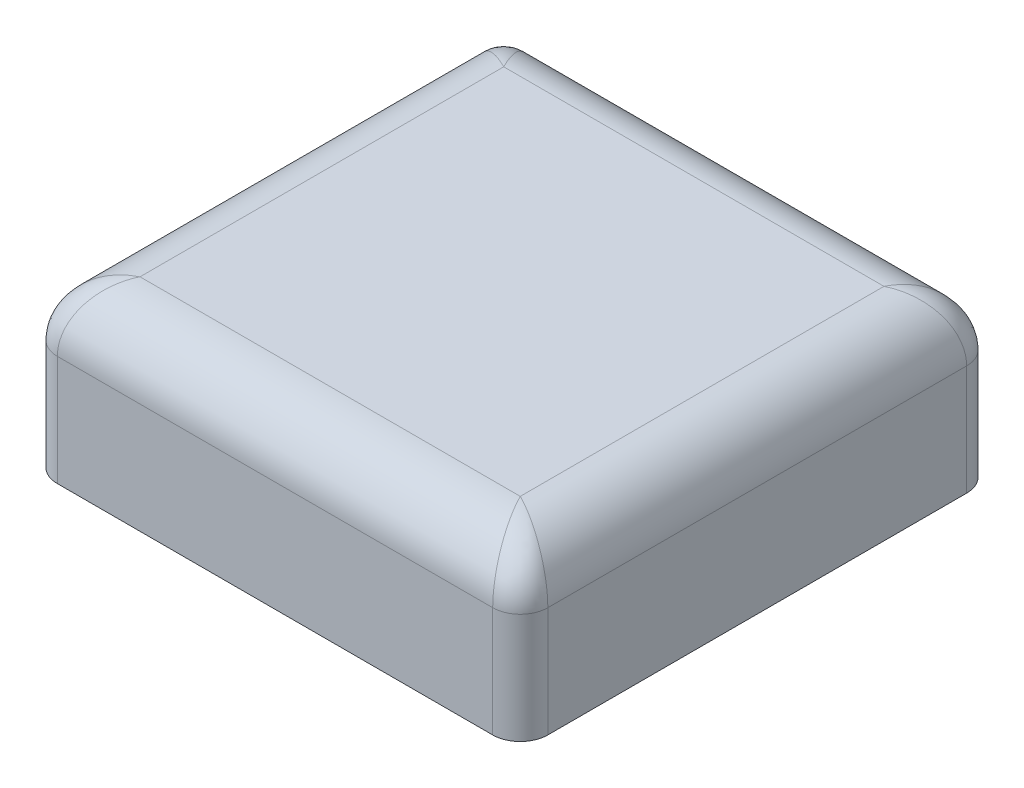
ISO-10303-21;
HEADER;
FILE_DESCRIPTION(('STEP AP214'),'2;1');
FILE_NAME('part.step','',(''),(''),'','','');
FILE_SCHEMA(('AUTOMOTIVE_DESIGN { 1 0 10303 214 1 1 1 1 }'));
ENDSEC;
DATA;
#1=APPLICATION_CONTEXT('core data for automotive mechanical design processes');
#2=APPLICATION_PROTOCOL_DEFINITION('international standard','automotive_design',2000,#1);
#3=PRODUCT_CONTEXT('',#1,'mechanical');
#4=PRODUCT('Part','Part','',(#3));
#5=PRODUCT_RELATED_PRODUCT_CATEGORY('part','',(#4));
#6=PRODUCT_DEFINITION_FORMATION('','',#4);
#7=PRODUCT_DEFINITION_CONTEXT('part definition',#1,'design');
#8=PRODUCT_DEFINITION('design','',#6,#7);
#9=PRODUCT_DEFINITION_SHAPE('','',#8);
#10=(LENGTH_UNIT() NAMED_UNIT(*) SI_UNIT(.MILLI.,.METRE.));
#11=(NAMED_UNIT(*) PLANE_ANGLE_UNIT() SI_UNIT($,.RADIAN.));
#12=(NAMED_UNIT(*) SI_UNIT($,.STERADIAN.) SOLID_ANGLE_UNIT());
#13=UNCERTAINTY_MEASURE_WITH_UNIT(LENGTH_MEASURE(1.E-05),#10,'distance_accuracy_value','');
#14=(GEOMETRIC_REPRESENTATION_CONTEXT(3) GLOBAL_UNCERTAINTY_ASSIGNED_CONTEXT((#13)) GLOBAL_UNIT_ASSIGNED_CONTEXT((#10,
#11,#12)) REPRESENTATION_CONTEXT('',''));
#15=CARTESIAN_POINT('',(0.,0.,0.));
#16=DIRECTION('',(0.,0.,1.));
#17=DIRECTION('',(1.,0.,0.));
#18=AXIS2_PLACEMENT_3D('',#15,#16,#17);
#19=CARTESIAN_POINT('',(6.9,6.,6.6));
#20=CARTESIAN_POINT('',(6.9,6.,6.6));
#21=CARTESIAN_POINT('',(6.9,6.,6.6));
#22=CARTESIAN_POINT('',(7.03092328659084,6.,6.86184657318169));
#23=CARTESIAN_POINT('',(7.09633697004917,5.99990745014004,6.79633697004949));
#24=CARTESIAN_POINT('',(7.16184657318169,6.,6.73092328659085));
#25=CARTESIAN_POINT('',(7.16174789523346,5.94794534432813,7.12349579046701));
#26=CARTESIAN_POINT('',(7.29743864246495,5.97379281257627,6.99743864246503));
#27=CARTESIAN_POINT('',(7.42349579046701,5.94794534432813,6.86174789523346));
#28=CARTESIAN_POINT('',(7.40361896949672,5.74757278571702,7.60723793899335));
#29=CARTESIAN_POINT('',(7.69066511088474,5.86499769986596,7.39066511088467));
#30=CARTESIAN_POINT('',(7.90723793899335,5.74757278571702,7.10361896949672));
#31=CARTESIAN_POINT('',(7.51454673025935,5.59933366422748,7.82909346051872));
#32=CARTESIAN_POINT('',(7.8912764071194,5.77802397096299,7.59127640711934));
#33=CARTESIAN_POINT('',(8.12909346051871,5.59933366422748,7.21454673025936));
#34=CARTESIAN_POINT('',(7.65338680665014,5.3216535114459,8.10677361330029));
#35=CARTESIAN_POINT('',(8.17839265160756,5.58157591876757,7.8783926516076));
#36=CARTESIAN_POINT('',(8.40677361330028,5.3216535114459,7.35338680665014));
#37=CARTESIAN_POINT('',(7.6951076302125,5.21997956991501,8.190215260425));
#38=CARTESIAN_POINT('',(8.27543637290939,5.50077375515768,7.97543637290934));
#39=CARTESIAN_POINT('',(8.490215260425,5.21997956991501,7.39510763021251));
#40=CARTESIAN_POINT('',(7.76783159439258,5.0023013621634,8.33566318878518));
#41=CARTESIAN_POINT('',(8.46254638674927,5.30395656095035,8.16254638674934));
#42=CARTESIAN_POINT('',(8.63566318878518,5.0023013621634,7.46783159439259));
#43=CARTESIAN_POINT('',(7.79883296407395,4.8863023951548,8.39766592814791));
#44=CARTESIAN_POINT('',(8.55188955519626,5.18653773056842,8.25188955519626));
#45=CARTESIAN_POINT('',(8.69766592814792,4.88630239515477,7.49883296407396));
#46=CARTESIAN_POINT('',(7.84892610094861,4.64443133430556,8.49785220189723));
#47=CARTESIAN_POINT('',(8.71080415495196,4.9084138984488,8.41080415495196));
#48=CARTESIAN_POINT('',(8.79785220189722,4.64443133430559,7.54892610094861));
#49=CARTESIAN_POINT('',(7.86801665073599,4.51856511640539,8.53603330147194));
#50=CARTESIAN_POINT('',(8.77831487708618,4.74763398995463,8.47831487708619));
#51=CARTESIAN_POINT('',(8.83603330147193,4.51856511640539,7.56801665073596));
#52=CARTESIAN_POINT('',(7.89355391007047,4.26179617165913,8.58710782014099));
#53=CARTESIAN_POINT('',(8.87406081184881,4.38998141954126,8.57406081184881));
#54=CARTESIAN_POINT('',(8.88710782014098,4.26179617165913,7.5935539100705));
#55=CARTESIAN_POINT('',(7.89999999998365,4.1309011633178,8.6));
#56=CARTESIAN_POINT('',(8.89999999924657,4.19659951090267,8.59999999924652));
#57=CARTESIAN_POINT('',(8.9,4.1309011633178,7.59999999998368));
#58=CARTESIAN_POINT('',(7.9,4.,8.6));
#59=CARTESIAN_POINT('',(8.9,4.,8.6));
#60=CARTESIAN_POINT('',(8.9,4.,7.6));
#61=(BOUNDED_SURFACE() B_SPLINE_SURFACE(3,2,((#19,#20,#21),(#22,#23,#24),(#25,#26,#27),(#28,#29,
#30),(#31,#32,#33),(#34,#35,#36),(#37,#38,#39),(#40,#41,#42),(#43,#44,#45),(#46,#47,#48),(#49,
#50,#51),(#52,#53,#54),(#55,#56,#57),(#58,#59,#60)),.UNSPECIFIED.,.F.,.F.,
.F.) B_SPLINE_SURFACE_WITH_KNOTS((4,2,2,2,2,2,4),(3,3),(1.5707963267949,1.96349540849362,
2.35619449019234,2.55254403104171,2.74889357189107,2.94524311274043,3.14159265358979),(0.,1.),
.UNSPECIFIED.) GEOMETRIC_REPRESENTATION_ITEM() RATIONAL_B_SPLINE_SURFACE(((1.,1.,1.),(1.,
1.00015858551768,1.),(1.,0.986729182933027,1.),(1.,0.938655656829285,1.),(1.,0.903812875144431,
1.),(1.,0.847131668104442,1.),(1.,0.827594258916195,1.),(1.,0.790218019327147,1.),(1.,
0.772396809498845,1.),(1.,0.741833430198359,1.),(1.,0.729128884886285,1.),(1.,0.711746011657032,
1.),(1.,0.707071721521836,1.),(1.,0.707106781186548,1.))) REPRESENTATION_ITEM('') SURFACE());
#62=CARTESIAN_POINT('',(7.9,4.,7.6));
#63=DIRECTION('',(0.,1.,0.));
#64=DIRECTION('',(0.,0.,1.));
#65=AXIS2_PLACEMENT_3D('',#62,#63,#64);
#66=CIRCLE('',#65,1.);
#67=CARTESIAN_POINT('',(7.9,4.,8.6));
#68=VERTEX_POINT('',#67);
#69=CARTESIAN_POINT('',(8.9,4.,7.59999999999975));
#70=VERTEX_POINT('',#69);
#71=EDGE_CURVE('E360',#68,#70,#66,.T.);
#72=CARTESIAN_POINT('',(8.9,4.,7.6));
#73=CARTESIAN_POINT('',(8.9,4.1309011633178,7.59999999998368));
#74=CARTESIAN_POINT('',(8.88710782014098,4.26179617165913,7.5935539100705));
#75=CARTESIAN_POINT('',(8.83603330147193,4.51856511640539,7.56801665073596));
#76=CARTESIAN_POINT('',(8.79785220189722,4.64443133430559,7.54892610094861));
#77=CARTESIAN_POINT('',(8.69766592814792,4.88630239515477,7.49883296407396));
#78=CARTESIAN_POINT('',(8.63566318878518,5.0023013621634,7.46783159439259));
#79=CARTESIAN_POINT('',(8.490215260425,5.21997956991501,7.39510763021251));
#80=CARTESIAN_POINT('',(8.40677361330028,5.3216535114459,7.35338680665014));
#81=CARTESIAN_POINT('',(8.12909346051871,5.59933366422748,7.21454673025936));
#82=CARTESIAN_POINT('',(7.90723793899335,5.74757278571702,7.10361896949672));
#83=CARTESIAN_POINT('',(7.42349579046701,5.94794534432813,6.86174789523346));
#84=CARTESIAN_POINT('',(7.16184657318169,6.,6.73092328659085));
#85=CARTESIAN_POINT('',(6.9,6.,6.6));
#86=(BOUNDED_CURVE() B_SPLINE_CURVE(3,(#72,#73,#74,#75,#76,#77,#78,#79,#80,#81,#82,#83,#84,#85),
.UNSPECIFIED.,.F.,.F.) B_SPLINE_CURVE_WITH_KNOTS((4,2,2,2,2,2,4),(1.5707963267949,
1.76714586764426,1.96349540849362,2.15984494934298,2.35619449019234,2.74889357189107,
3.14159265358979),
.UNSPECIFIED.) CURVE() GEOMETRIC_REPRESENTATION_ITEM() RATIONAL_B_SPLINE_CURVE((1.,1.,1.,1.,1.,
1.,1.,1.,1.,1.,1.,1.,1.,1.)) REPRESENTATION_ITEM(''));
#87=CARTESIAN_POINT('',(6.9,6.,6.6));
#88=VERTEX_POINT('',#87);
#89=EDGE_CURVE('E271',#88,#70,#86,.F.);
#90=CARTESIAN_POINT('',(6.9,6.,6.6));
#91=CARTESIAN_POINT('',(6.92181562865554,5.99999843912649,6.64363125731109));
#92=CARTESIAN_POINT('',(6.94363072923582,5.99855462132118,6.68726145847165));
#93=CARTESIAN_POINT('',(6.98716468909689,5.99280866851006,6.77432937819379));
#94=CARTESIAN_POINT('',(7.0088836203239,5.98850926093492,6.81776724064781));
#95=CARTESIAN_POINT('',(7.05213453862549,5.97708811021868,6.90426907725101));
#96=CARTESIAN_POINT('',(7.07366678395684,5.96997125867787,6.94733356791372));
#97=CARTESIAN_POINT('',(7.11645319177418,5.95294910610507,7.03290638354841));
#98=CARTESIAN_POINT('',(7.13770792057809,5.94305091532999,7.07541584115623));
#99=CARTESIAN_POINT('',(7.17985032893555,5.92049891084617,7.15970065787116));
#100=CARTESIAN_POINT('',(7.20073899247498,5.9078543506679,7.20147798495));
#101=CARTESIAN_POINT('',(7.2317565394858,5.88682730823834,7.26351307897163));
#102=CARTESIAN_POINT('',(7.24202875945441,5.87948682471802,7.28405751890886));
#103=CARTESIAN_POINT('',(7.2624473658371,5.8641311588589,7.32489473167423));
#104=CARTESIAN_POINT('',(7.27259397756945,5.85611748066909,7.34518795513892));
#105=CARTESIAN_POINT('',(7.29274874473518,5.83942064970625,7.38549748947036));
#106=CARTESIAN_POINT('',(7.30275717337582,5.83073914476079,7.40551434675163));
#107=CARTESIAN_POINT('',(7.32262506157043,5.81271991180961,7.44525012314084));
#108=CARTESIAN_POINT('',(7.33248483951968,5.80338393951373,7.46496967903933));
#109=CARTESIAN_POINT('',(7.35204570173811,5.78406870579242,7.50409140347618));
#110=CARTESIAN_POINT('',(7.36174714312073,5.77409125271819,7.52349428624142));
#111=CARTESIAN_POINT('',(7.38098162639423,5.75350591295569,7.56196325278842));
#112=CARTESIAN_POINT('',(7.39051506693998,5.74289988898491,7.58103013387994));
#113=CARTESIAN_POINT('',(7.40940383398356,5.72107028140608,7.6188076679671));
#114=CARTESIAN_POINT('',(7.41875960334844,5.70984861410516,7.63751920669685));
#115=CARTESIAN_POINT('',(7.43728331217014,5.68680058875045,7.67456662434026));
#116=CARTESIAN_POINT('',(7.44645174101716,5.67497619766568,7.6929034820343));
#117=CARTESIAN_POINT('',(7.46459105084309,5.65073559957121,7.72918210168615));
#118=CARTESIAN_POINT('',(7.47356246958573,5.63832140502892,7.74712493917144));
#119=CARTESIAN_POINT('',(7.4912980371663,5.61291407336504,7.78259607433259));
#120=CARTESIAN_POINT('',(7.50006277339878,5.59992298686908,7.80012554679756));
#121=CARTESIAN_POINT('',(7.51737526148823,5.57337477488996,7.83475052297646));
#122=CARTESIAN_POINT('',(7.5259236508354,5.55981972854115,7.85184730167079));
#123=CARTESIAN_POINT('',(7.54279369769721,5.53215642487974,7.88558739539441));
#124=CARTESIAN_POINT('',(7.55111604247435,5.51805026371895,7.9022320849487));
#125=CARTESIAN_POINT('',(7.56752437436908,5.48929788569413,7.93504874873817));
#126=CARTESIAN_POINT('',(7.57561109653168,5.47465376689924,7.95122219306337));
#127=CARTESIAN_POINT('',(7.59153810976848,5.44483747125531,7.98307621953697));
#128=CARTESIAN_POINT('',(7.59937918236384,5.42966738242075,7.9987583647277));
#129=CARTESIAN_POINT('',(7.61480633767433,5.39881582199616,8.02961267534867));
#130=CARTESIAN_POINT('',(7.62239324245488,5.38313640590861,8.04478648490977));
#131=CARTESIAN_POINT('',(7.63730580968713,5.35128795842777,8.07461161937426));
#132=CARTESIAN_POINT('',(7.64463232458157,5.33512092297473,8.08926464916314));
#133=CARTESIAN_POINT('',(7.65901632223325,5.30231442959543,8.1180326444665));
#134=CARTESIAN_POINT('',(7.66607468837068,5.28567690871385,8.13214937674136));
#135=CARTESIAN_POINT('',(7.67991505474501,5.25194778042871,8.15983010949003));
#136=CARTESIAN_POINT('',(7.68669796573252,5.23485804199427,8.17339593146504));
#137=CARTESIAN_POINT('',(7.69997996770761,5.20024251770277,8.19995993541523));
#138=CARTESIAN_POINT('',(7.70647999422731,5.18271852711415,8.21295998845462));
#139=CARTESIAN_POINT('',(7.71918881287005,5.14725261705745,8.23837762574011));
#140=CARTESIAN_POINT('',(7.72539856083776,5.12931241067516,8.25079712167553));
#141=CARTESIAN_POINT('',(7.73751935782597,5.09303229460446,8.27503871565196));
#142=CARTESIAN_POINT('',(7.74343137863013,5.07469400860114,8.28686275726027));
#143=CARTESIAN_POINT('',(7.754951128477,5.03763866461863,8.30990225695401));
#144=CARTESIAN_POINT('',(7.76055983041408,5.01892311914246,8.32111966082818));
#145=CARTESIAN_POINT('',(7.77146745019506,4.98113394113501,8.34293490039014));
#146=CARTESIAN_POINT('',(7.77676733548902,4.96206170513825,8.35353467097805));
#147=CARTESIAN_POINT('',(7.78705182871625,4.92357983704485,8.37410365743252));
#148=CARTESIAN_POINT('',(7.79203739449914,4.90417148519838,8.38407478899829));
#149=CARTESIAN_POINT('',(7.80168775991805,4.86503807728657,8.40337551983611));
#150=CARTESIAN_POINT('',(7.80635350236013,4.84531418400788,8.41270700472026));
#151=CARTESIAN_POINT('',(7.81535874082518,4.80557037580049,8.43071748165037));
#152=CARTESIAN_POINT('',(7.81969915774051,4.78555150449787,8.43939831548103));
#153=CARTESIAN_POINT('',(7.82804823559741,4.74523858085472,8.45609647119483));
#154=CARTESIAN_POINT('',(7.83205778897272,4.72494545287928,8.46411557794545));
#155=CARTESIAN_POINT('',(7.83974173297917,4.68410673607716,8.47948346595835));
#156=CARTESIAN_POINT('',(7.84341697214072,4.66356194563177,8.48683394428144));
#157=CARTESIAN_POINT('',(7.85042895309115,4.62224234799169,8.5008579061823));
#158=CARTESIAN_POINT('',(7.85376649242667,4.60146821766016,8.50753298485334));
#159=CARTESIAN_POINT('',(7.86009973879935,4.55971238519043,8.52019947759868));
#160=CARTESIAN_POINT('',(7.86309618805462,4.53873124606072,8.52619237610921));
#161=CARTESIAN_POINT('',(7.86874392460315,4.49658383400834,8.5374878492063));
#162=CARTESIAN_POINT('',(7.87139589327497,4.47541801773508,8.54279178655));
#163=CARTESIAN_POINT('',(7.87635134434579,4.43292366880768,8.5527026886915));
#164=CARTESIAN_POINT('',(7.87865544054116,4.41159549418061,8.55731088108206));
#165=CARTESIAN_POINT('',(7.88291181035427,4.36879907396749,8.56582362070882));
#166=CARTESIAN_POINT('',(7.88486462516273,4.347331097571,8.56972925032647));
#167=CARTESIAN_POINT('',(7.88841734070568,4.30427864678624,8.57683468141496));
#168=CARTESIAN_POINT('',(7.8900176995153,4.28269436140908,8.58003539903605));
#169=CARTESIAN_POINT('',(7.89286444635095,4.23943253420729,8.58572889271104));
#170=CARTESIAN_POINT('',(7.89411120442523,4.21775511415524,8.58822240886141));
#171=CARTESIAN_POINT('',(7.89624970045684,4.17433026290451,8.59249940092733));
#172=CARTESIAN_POINT('',(7.89714171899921,4.15258290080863,8.59428343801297));
#173=CARTESIAN_POINT('',(7.89856966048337,4.1090413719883,8.59713932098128));
#174=CARTESIAN_POINT('',(7.89910577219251,4.08724723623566,8.59821154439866));
#175=CARTESIAN_POINT('',(7.89982092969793,4.04363543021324,8.59964185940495));
#176=CARTESIAN_POINT('',(7.90000006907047,4.0218177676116,8.6000001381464));
#177=CARTESIAN_POINT('',(7.9,4.,8.6));
#178=B_SPLINE_CURVE_WITH_KNOTS('',3,(#90,#91,#92,#93,#94,#95,#96,#97,#98,#99,#100,#101,#102,
#103,#104,#105,#106,#107,#108,#109,#110,#111,#112,#113,#114,#115,#116,#117,#118,#119,#120,#121,
#122,#123,#124,#125,#126,#127,#128,#129,#130,#131,#132,#133,#134,#135,#136,#137,#138,#139,#140,
#141,#142,#143,#144,#145,#146,#147,#148,#149,#150,#151,#152,#153,#154,#155,#156,#157,#158,#159,
#160,#161,#162,#163,#164,#165,#166,#167,#168,#169,#170,#171,#172,#173,#174,#175,#176,#177),
.UNSPECIFIED.,.F.,.F.,(4,2,2,2,2,2,2,2,2,2,2,2,2,2,2,2,2,2,2,2,2,2,2,2,2,2,2,2,2,2,2,2,2,2,2,2,
2,2,2,2,2,2,2,4),(0.,0.146320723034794,0.292501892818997,0.438430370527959,0.58398913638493,
0.72906486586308,0.801397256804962,0.873572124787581,0.945574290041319,1.01739018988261,
1.08901183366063,1.16043092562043,1.23163909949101,1.30262815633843,1.37339030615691,
1.44391841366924,1.51420624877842,1.58424874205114,1.65404224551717,1.72358479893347,
1.79287499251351,1.86191228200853,1.93069789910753,1.99923365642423,2.06752219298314,
2.13556722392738,2.20337345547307,2.27094743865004,2.33829688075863,2.40543003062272,
2.4723559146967,2.53908457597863,2.60562692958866,2.67199538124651,2.73820324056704,
2.804264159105,2.87019235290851,2.93600282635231,3.00171102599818,3.06733331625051,
3.13288667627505,3.1983880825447,3.26385472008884,3.32930419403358),.UNSPECIFIED.);
#179=EDGE_CURVE('E261',#68,#88,#178,.F.);
#180=ORIENTED_EDGE('',*,*,#71,.T.);
#181=ORIENTED_EDGE('',*,*,#89,.F.);
#182=ORIENTED_EDGE('',*,*,#179,.F.);
#183=EDGE_LOOP('',(#180,#181,#182));
#184=FACE_BOUND('',#183,.T.);
#185=ADVANCED_FACE('F17',(#184),#61,.T.);
#186=CARTESIAN_POINT('',(-6.9,6.,6.6));
#187=CARTESIAN_POINT('',(-6.9,6.,6.6));
#188=CARTESIAN_POINT('',(-6.9,6.,6.6));
#189=CARTESIAN_POINT('',(-7.1618465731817,6.,6.73092328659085));
#190=CARTESIAN_POINT('',(-7.09633697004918,5.99990745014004,6.7963369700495));
#191=CARTESIAN_POINT('',(-7.03092328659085,6.,6.86184657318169));
#192=CARTESIAN_POINT('',(-7.42349579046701,5.94794534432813,6.86174789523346));
#193=CARTESIAN_POINT('',(-7.29743864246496,5.97379281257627,6.99743864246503));
#194=CARTESIAN_POINT('',(-7.16174789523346,5.94794534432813,7.12349579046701));
#195=CARTESIAN_POINT('',(-7.90723793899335,5.74757278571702,7.10361896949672));
#196=CARTESIAN_POINT('',(-7.69066511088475,5.86499769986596,7.39066511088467));
#197=CARTESIAN_POINT('',(-7.40361896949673,5.74757278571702,7.60723793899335));
#198=CARTESIAN_POINT('',(-8.12909346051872,5.59933366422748,7.21454673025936));
#199=CARTESIAN_POINT('',(-7.8912764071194,5.77802397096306,7.59127640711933));
#200=CARTESIAN_POINT('',(-7.51454673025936,5.59933366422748,7.82909346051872));
#201=CARTESIAN_POINT('',(-8.40677361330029,5.3216535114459,7.35338680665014));
#202=CARTESIAN_POINT('',(-8.17839265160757,5.58157591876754,7.8783926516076));
#203=CARTESIAN_POINT('',(-7.65338680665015,5.3216535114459,8.10677361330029));
#204=CARTESIAN_POINT('',(-8.49021526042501,5.21997956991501,7.39510763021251));
#205=CARTESIAN_POINT('',(-8.27543637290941,5.50077375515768,7.97543637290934));
#206=CARTESIAN_POINT('',(-7.69510763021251,5.21997956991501,8.190215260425));
#207=CARTESIAN_POINT('',(-8.63566318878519,5.0023013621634,7.46783159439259));
#208=CARTESIAN_POINT('',(-8.46254638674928,5.30395656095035,8.16254638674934));
#209=CARTESIAN_POINT('',(-7.76783159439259,5.0023013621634,8.33566318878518));
#210=CARTESIAN_POINT('',(-8.69766592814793,4.88630239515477,7.49883296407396));
#211=CARTESIAN_POINT('',(-8.55188955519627,5.18653773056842,8.25188955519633));
#212=CARTESIAN_POINT('',(-7.79883296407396,4.8863023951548,8.39766592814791));
#213=CARTESIAN_POINT('',(-8.79785220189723,4.64443133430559,7.54892610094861));
#214=CARTESIAN_POINT('',(-8.71080415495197,4.9084138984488,8.4108041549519));
#215=CARTESIAN_POINT('',(-7.84892610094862,4.64443133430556,8.49785220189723));
#216=CARTESIAN_POINT('',(-8.83603330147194,4.51856511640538,7.56801665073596));
#217=CARTESIAN_POINT('',(-8.77831487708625,4.74763398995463,8.47831487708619));
#218=CARTESIAN_POINT('',(-7.86801665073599,4.51856511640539,8.53603330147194));
#219=CARTESIAN_POINT('',(-8.88710782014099,4.26179617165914,7.5935539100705));
#220=CARTESIAN_POINT('',(-8.87406081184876,4.38998141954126,8.57406081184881));
#221=CARTESIAN_POINT('',(-7.89355391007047,4.26179617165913,8.58710782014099));
#222=CARTESIAN_POINT('',(-8.90000000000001,4.13090116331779,7.59999999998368));
#223=CARTESIAN_POINT('',(-8.89999999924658,4.19659951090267,8.59999999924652));
#224=CARTESIAN_POINT('',(-7.89999999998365,4.1309011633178,8.6));
#225=CARTESIAN_POINT('',(-8.90000000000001,4.,7.6));
#226=CARTESIAN_POINT('',(-8.90000000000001,4.,8.6));
#227=CARTESIAN_POINT('',(-7.9,4.,8.6));
#228=(BOUNDED_SURFACE() B_SPLINE_SURFACE(3,2,((#186,#187,#188),(#189,#190,#191),(#192,#193,
#194),(#195,#196,#197),(#198,#199,#200),(#201,#202,#203),(#204,#205,#206),(#207,#208,#209),
(#210,#211,#212),(#213,#214,#215),(#216,#217,#218),(#219,#220,#221),(#222,#223,#224),(#225,#226,
#227)),.UNSPECIFIED.,.F.,.F.,.F.) B_SPLINE_SURFACE_WITH_KNOTS((4,2,2,2,2,2,4),(3,3),
(1.5707963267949,1.96349540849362,2.35619449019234,2.55254403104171,2.74889357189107,
2.94524311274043,3.14159265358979),(0.,1.),
.UNSPECIFIED.) GEOMETRIC_REPRESENTATION_ITEM() RATIONAL_B_SPLINE_SURFACE(((1.,1.,1.),(1.,
1.00015858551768,1.),(1.,0.986729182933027,1.),(1.,0.938655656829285,1.),(1.,0.903812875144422,
1.),(1.,0.847131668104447,1.),(1.,0.82759425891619,1.),(1.,0.790218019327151,1.),(1.,
0.772396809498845,1.),(1.,0.741833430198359,1.),(1.,0.729128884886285,1.),(1.,0.711746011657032,
1.),(1.,0.707071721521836,1.),(1.,0.707106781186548,1.))) REPRESENTATION_ITEM('') SURFACE());
#229=CARTESIAN_POINT('',(-7.9,4.,7.6));
#230=DIRECTION('',(0.,1.,0.));
#231=DIRECTION('',(0.,0.,1.));
#232=AXIS2_PLACEMENT_3D('',#229,#230,#231);
#233=CIRCLE('',#232,1.);
#234=CARTESIAN_POINT('',(-8.90000000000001,4.,7.6));
#235=VERTEX_POINT('',#234);
#236=CARTESIAN_POINT('',(-7.89999999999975,4.,8.6));
#237=VERTEX_POINT('',#236);
#238=EDGE_CURVE('E389',#235,#237,#233,.T.);
#239=CARTESIAN_POINT('',(-7.90000000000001,4.,8.6));
#240=CARTESIAN_POINT('',(-7.89999999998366,4.13090116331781,8.6));
#241=CARTESIAN_POINT('',(-7.89355391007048,4.26179617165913,8.58710782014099));
#242=CARTESIAN_POINT('',(-7.868016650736,4.51856511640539,8.53603330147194));
#243=CARTESIAN_POINT('',(-7.84892610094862,4.64443133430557,8.49785220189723));
#244=CARTESIAN_POINT('',(-7.79883296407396,4.8863023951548,8.39766592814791));
#245=CARTESIAN_POINT('',(-7.76783159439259,5.0023013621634,8.33566318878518));
#246=CARTESIAN_POINT('',(-7.69510763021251,5.21997956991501,8.190215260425));
#247=CARTESIAN_POINT('',(-7.65338680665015,5.3216535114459,8.10677361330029));
#248=CARTESIAN_POINT('',(-7.51454673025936,5.59933366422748,7.82909346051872));
#249=CARTESIAN_POINT('',(-7.40361896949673,5.74757278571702,7.60723793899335));
#250=CARTESIAN_POINT('',(-7.16174789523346,5.94794534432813,7.12349579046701));
#251=CARTESIAN_POINT('',(-7.03092328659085,6.,6.86184657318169));
#252=CARTESIAN_POINT('',(-6.9,6.,6.6));
#253=(BOUNDED_CURVE() B_SPLINE_CURVE(3,(#239,#240,#241,#242,#243,#244,#245,#246,#247,#248,#249,
#250,#251,#252),.UNSPECIFIED.,.F.,.F.) B_SPLINE_CURVE_WITH_KNOTS((4,2,2,2,2,2,4),
(1.5707963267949,1.76714586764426,1.96349540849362,2.15984494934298,2.35619449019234,
2.74889357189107,3.14159265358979),
.UNSPECIFIED.) CURVE() GEOMETRIC_REPRESENTATION_ITEM() RATIONAL_B_SPLINE_CURVE((1.,1.,1.,1.,1.,
1.,1.,1.,1.,1.,1.,1.,1.,1.)) REPRESENTATION_ITEM(''));
#254=CARTESIAN_POINT('',(-6.9,6.,6.6));
#255=VERTEX_POINT('',#254);
#256=EDGE_CURVE('E232',#255,#237,#253,.F.);
#257=CARTESIAN_POINT('',(-6.9,6.,6.6));
#258=CARTESIAN_POINT('',(-7.1618465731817,6.,6.73092328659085));
#259=CARTESIAN_POINT('',(-7.42349579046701,5.94794534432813,6.86174789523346));
#260=CARTESIAN_POINT('',(-7.90723793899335,5.74757278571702,7.10361896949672));
#261=CARTESIAN_POINT('',(-8.12909346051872,5.59933366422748,7.21454673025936));
#262=CARTESIAN_POINT('',(-8.40677361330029,5.3216535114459,7.35338680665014));
#263=CARTESIAN_POINT('',(-8.49021526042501,5.21997956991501,7.39510763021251));
#264=CARTESIAN_POINT('',(-8.63566318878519,5.0023013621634,7.46783159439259));
#265=CARTESIAN_POINT('',(-8.69766592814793,4.88630239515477,7.49883296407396));
#266=CARTESIAN_POINT('',(-8.79785220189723,4.64443133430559,7.54892610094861));
#267=CARTESIAN_POINT('',(-8.83603330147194,4.51856511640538,7.56801665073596));
#268=CARTESIAN_POINT('',(-8.88710782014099,4.26179617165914,7.5935539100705));
#269=CARTESIAN_POINT('',(-8.90000000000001,4.13090116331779,7.59999999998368));
#270=CARTESIAN_POINT('',(-8.90000000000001,4.,7.6));
#271=(BOUNDED_CURVE() B_SPLINE_CURVE(3,(#257,#258,#259,#260,#261,#262,#263,#264,#265,#266,#267,
#268,#269,#270),.UNSPECIFIED.,.F.,.F.) B_SPLINE_CURVE_WITH_KNOTS((4,2,2,2,2,2,4),
(1.5707963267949,1.96349540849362,2.35619449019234,2.55254403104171,2.74889357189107,
2.94524311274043,3.14159265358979),
.UNSPECIFIED.) CURVE() GEOMETRIC_REPRESENTATION_ITEM() RATIONAL_B_SPLINE_CURVE((1.,1.,1.,1.,1.,
1.,1.,1.,1.,1.,1.,1.,1.,1.)) REPRESENTATION_ITEM(''));
#272=EDGE_CURVE('E219',#235,#255,#271,.F.);
#273=ORIENTED_EDGE('',*,*,#238,.T.);
#274=ORIENTED_EDGE('',*,*,#256,.F.);
#275=ORIENTED_EDGE('',*,*,#272,.F.);
#276=EDGE_LOOP('',(#273,#274,#275));
#277=FACE_BOUND('',#276,.T.);
#278=ADVANCED_FACE('F393',(#277),#228,.T.);
#279=CARTESIAN_POINT('',(-6.9,6.,-6.6));
#280=CARTESIAN_POINT('',(-6.9,6.,-6.6));
#281=CARTESIAN_POINT('',(-6.9,6.,-6.6));
#282=CARTESIAN_POINT('',(-7.03092328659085,6.,-6.86184657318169));
#283=CARTESIAN_POINT('',(-7.09633697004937,5.99990745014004,-6.79633697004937));
#284=CARTESIAN_POINT('',(-7.1618465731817,6.,-6.73092328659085));
#285=CARTESIAN_POINT('',(-7.16174789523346,5.94794534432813,-7.12349579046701));
#286=CARTESIAN_POINT('',(-7.29743864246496,5.97379281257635,-6.99743864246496));
#287=CARTESIAN_POINT('',(-7.42349579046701,5.94794534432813,-6.86174789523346));
#288=CARTESIAN_POINT('',(-7.40361896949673,5.74757278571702,-7.60723793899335));
#289=CARTESIAN_POINT('',(-7.69066511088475,5.86499769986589,-7.39066511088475));
#290=CARTESIAN_POINT('',(-7.90723793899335,5.74757278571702,-7.10361896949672));
#291=CARTESIAN_POINT('',(-7.51454673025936,5.59933366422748,-7.82909346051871));
#292=CARTESIAN_POINT('',(-7.8912764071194,5.77802397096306,-7.59127640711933));
#293=CARTESIAN_POINT('',(-8.12909346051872,5.59933366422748,-7.21454673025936));
#294=CARTESIAN_POINT('',(-7.65338680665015,5.3216535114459,-8.10677361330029));
#295=CARTESIAN_POINT('',(-8.17839265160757,5.58157591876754,-7.8783926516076));
#296=CARTESIAN_POINT('',(-8.40677361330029,5.3216535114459,-7.35338680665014));
#297=CARTESIAN_POINT('',(-7.69510763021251,5.21997956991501,-8.190215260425));
#298=CARTESIAN_POINT('',(-8.27543637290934,5.50077375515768,-7.9754363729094));
#299=CARTESIAN_POINT('',(-8.49021526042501,5.21997956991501,-7.39510763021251));
#300=CARTESIAN_POINT('',(-7.76783159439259,5.0023013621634,-8.33566318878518));
#301=CARTESIAN_POINT('',(-8.46254638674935,5.30395656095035,-8.16254638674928));
#302=CARTESIAN_POINT('',(-8.63566318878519,5.0023013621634,-7.46783159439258));
#303=CARTESIAN_POINT('',(-7.79883296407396,4.8863023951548,-8.39766592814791));
#304=CARTESIAN_POINT('',(-8.55188955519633,5.18653773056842,-8.25188955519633));
#305=CARTESIAN_POINT('',(-8.69766592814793,4.88630239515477,-7.49883296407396));
#306=CARTESIAN_POINT('',(-7.84892610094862,4.64443133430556,-8.49785220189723));
#307=CARTESIAN_POINT('',(-8.71080415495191,4.90841389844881,-8.4108041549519));
#308=CARTESIAN_POINT('',(-8.79785220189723,4.64443133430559,-7.54892610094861));
#309=CARTESIAN_POINT('',(-7.86801665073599,4.51856511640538,-8.53603330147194));
#310=CARTESIAN_POINT('',(-8.77831487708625,4.74763398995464,-8.47831487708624));
#311=CARTESIAN_POINT('',(-8.83603330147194,4.51856511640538,-7.56801665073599));
#312=CARTESIAN_POINT('',(-7.89355391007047,4.26179617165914,-8.58710782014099));
#313=CARTESIAN_POINT('',(-8.87406081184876,4.38998141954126,-8.57406081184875));
#314=CARTESIAN_POINT('',(-8.88710782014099,4.26179617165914,-7.59355391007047));
#315=CARTESIAN_POINT('',(-7.89999999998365,4.13090116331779,-8.6));
#316=CARTESIAN_POINT('',(-8.89999999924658,4.19659951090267,-8.59999999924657));
#317=CARTESIAN_POINT('',(-8.90000000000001,4.13090116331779,-7.59999999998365));
#318=CARTESIAN_POINT('',(-7.9,4.,-8.6));
#319=CARTESIAN_POINT('',(-8.90000000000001,4.,-8.6));
#320=CARTESIAN_POINT('',(-8.90000000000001,4.,-7.6));
#321=(BOUNDED_SURFACE() B_SPLINE_SURFACE(3,2,((#279,#280,#281),(#282,#283,#284),(#285,#286,
#287),(#288,#289,#290),(#291,#292,#293),(#294,#295,#296),(#297,#298,#299),(#300,#301,#302),
(#303,#304,#305),(#306,#307,#308),(#309,#310,#311),(#312,#313,#314),(#315,#316,#317),(#318,#319,
#320)),.UNSPECIFIED.,.F.,.F.,.F.) B_SPLINE_SURFACE_WITH_KNOTS((4,2,2,2,2,2,4),(3,3),
(1.5707963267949,1.96349540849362,2.35619449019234,2.55254403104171,2.74889357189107,
2.94524311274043,3.14159265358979),(0.,1.),
.UNSPECIFIED.) GEOMETRIC_REPRESENTATION_ITEM() RATIONAL_B_SPLINE_SURFACE(((1.,1.,1.),(1.,
1.00015858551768,1.),(1.,0.986729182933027,1.),(1.,0.938655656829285,1.),(1.,0.903812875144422,
1.),(1.,0.847131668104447,1.),(1.,0.827594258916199,1.),(1.,0.790218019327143,1.),(1.,
0.772396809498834,1.),(1.,0.741833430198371,1.),(1.,0.729128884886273,1.),(1.,0.711746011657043,
1.),(1.,0.707071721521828,1.),(1.,0.707106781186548,1.))) REPRESENTATION_ITEM('') SURFACE());
#322=CARTESIAN_POINT('',(-8.90000000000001,4.,-7.6));
#323=CARTESIAN_POINT('',(-8.90000000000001,4.13090116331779,-7.59999999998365));
#324=CARTESIAN_POINT('',(-8.88710782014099,4.26179617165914,-7.59355391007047));
#325=CARTESIAN_POINT('',(-8.83603330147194,4.51856511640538,-7.56801665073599));
#326=CARTESIAN_POINT('',(-8.79785220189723,4.64443133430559,-7.54892610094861));
#327=CARTESIAN_POINT('',(-8.69766592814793,4.88630239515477,-7.49883296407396));
#328=CARTESIAN_POINT('',(-8.63566318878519,5.0023013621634,-7.46783159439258));
#329=CARTESIAN_POINT('',(-8.49021526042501,5.21997956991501,-7.39510763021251));
#330=CARTESIAN_POINT('',(-8.40677361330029,5.3216535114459,-7.35338680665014));
#331=CARTESIAN_POINT('',(-8.12909346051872,5.59933366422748,-7.21454673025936));
#332=CARTESIAN_POINT('',(-7.90723793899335,5.74757278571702,-7.10361896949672));
#333=CARTESIAN_POINT('',(-7.42349579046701,5.94794534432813,-6.86174789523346));
#334=CARTESIAN_POINT('',(-7.1618465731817,6.,-6.73092328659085));
#335=CARTESIAN_POINT('',(-6.9,6.,-6.6));
#336=(BOUNDED_CURVE() B_SPLINE_CURVE(3,(#322,#323,#324,#325,#326,#327,#328,#329,#330,#331,#332,
#333,#334,#335),.UNSPECIFIED.,.F.,.F.) B_SPLINE_CURVE_WITH_KNOTS((4,2,2,2,2,2,4),
(1.5707963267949,1.76714586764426,1.96349540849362,2.15984494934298,2.35619449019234,
2.74889357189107,3.14159265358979),
.UNSPECIFIED.) CURVE() GEOMETRIC_REPRESENTATION_ITEM() RATIONAL_B_SPLINE_CURVE((1.,1.,1.,1.,1.,
1.,1.,1.,1.,1.,1.,1.,1.,1.)) REPRESENTATION_ITEM(''));
#337=CARTESIAN_POINT('',(-6.9,6.,-6.6));
#338=VERTEX_POINT('',#337);
#339=CARTESIAN_POINT('',(-8.90000000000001,4.,-7.59999999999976));
#340=VERTEX_POINT('',#339);
#341=EDGE_CURVE('E73',#338,#340,#336,.F.);
#342=CARTESIAN_POINT('',(-6.9,6.,-6.6));
#343=CARTESIAN_POINT('',(-7.03092328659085,6.,-6.86184657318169));
#344=CARTESIAN_POINT('',(-7.16174789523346,5.94794534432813,-7.12349579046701));
#345=CARTESIAN_POINT('',(-7.40361896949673,5.74757278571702,-7.60723793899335));
#346=CARTESIAN_POINT('',(-7.51454673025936,5.59933366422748,-7.82909346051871));
#347=CARTESIAN_POINT('',(-7.65338680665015,5.3216535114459,-8.10677361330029));
#348=CARTESIAN_POINT('',(-7.69510763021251,5.21997956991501,-8.190215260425));
#349=CARTESIAN_POINT('',(-7.76783159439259,5.0023013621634,-8.33566318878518));
#350=CARTESIAN_POINT('',(-7.79883296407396,4.8863023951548,-8.39766592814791));
#351=CARTESIAN_POINT('',(-7.84892610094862,4.64443133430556,-8.49785220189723));
#352=CARTESIAN_POINT('',(-7.86801665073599,4.51856511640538,-8.53603330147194));
#353=CARTESIAN_POINT('',(-7.89355391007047,4.26179617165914,-8.58710782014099));
#354=CARTESIAN_POINT('',(-7.89999999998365,4.13090116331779,-8.6));
#355=CARTESIAN_POINT('',(-7.9,4.,-8.6));
#356=(BOUNDED_CURVE() B_SPLINE_CURVE(3,(#342,#343,#344,#345,#346,#347,#348,#349,#350,#351,#352,
#353,#354,#355),.UNSPECIFIED.,.F.,.F.) B_SPLINE_CURVE_WITH_KNOTS((4,2,2,2,2,2,4),
(1.5707963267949,1.96349540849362,2.35619449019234,2.55254403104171,2.74889357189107,
2.94524311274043,3.14159265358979),
.UNSPECIFIED.) CURVE() GEOMETRIC_REPRESENTATION_ITEM() RATIONAL_B_SPLINE_CURVE((1.,1.,1.,1.,1.,
1.,1.,1.,1.,1.,1.,1.,1.,1.)) REPRESENTATION_ITEM(''));
#357=CARTESIAN_POINT('',(-7.89999999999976,4.,-8.6));
#358=VERTEX_POINT('',#357);
#359=EDGE_CURVE('E138',#358,#338,#356,.F.);
#360=CARTESIAN_POINT('',(-7.9,4.,-7.6));
#361=DIRECTION('',(0.,1.,0.));
#362=DIRECTION('',(0.,0.,1.));
#363=AXIS2_PLACEMENT_3D('',#360,#361,#362);
#364=CIRCLE('',#363,1.);
#365=EDGE_CURVE('E366',#358,#340,#364,.T.);
#366=ORIENTED_EDGE('',*,*,#341,.F.);
#367=ORIENTED_EDGE('',*,*,#359,.F.);
#368=ORIENTED_EDGE('',*,*,#365,.T.);
#369=EDGE_LOOP('',(#366,#367,#368));
#370=FACE_BOUND('',#369,.T.);
#371=ADVANCED_FACE('F391',(#370),#321,.T.);
#372=CARTESIAN_POINT('',(7.9,6.,-7.6));
#373=DIRECTION('',(0.,-1.,0.));
#374=DIRECTION('',(0.,0.,-1.));
#375=AXIS2_PLACEMENT_3D('',#372,#373,#374);
#376=PLANE('',#375);
#377=DIRECTION('',(0.,0.,-1.));
#378=VECTOR('',#377,1.);
#379=CARTESIAN_POINT('',(6.9,6.,-7.6));
#380=LINE('',#379,#378);
#381=CARTESIAN_POINT('',(6.9,6.,-6.6));
#382=VERTEX_POINT('',#381);
#383=EDGE_CURVE('E288',#382,#88,#380,.F.);
#384=ORIENTED_EDGE('',*,*,#383,.F.);
#385=DIRECTION('',(-1.,0.,0.));
#386=VECTOR('',#385,1.);
#387=CARTESIAN_POINT('',(7.9,6.,-6.6));
#388=LINE('',#387,#386);
#389=EDGE_CURVE('E164',#338,#382,#388,.F.);
#390=ORIENTED_EDGE('',*,*,#389,.F.);
#391=DIRECTION('',(0.,0.,1.));
#392=VECTOR('',#391,1.);
#393=CARTESIAN_POINT('',(-6.9,6.,-7.6));
#394=LINE('',#393,#392);
#395=EDGE_CURVE('E212',#255,#338,#394,.F.);
#396=ORIENTED_EDGE('',*,*,#395,.F.);
#397=DIRECTION('',(1.,0.,0.));
#398=VECTOR('',#397,1.);
#399=CARTESIAN_POINT('',(7.9,6.,6.6));
#400=LINE('',#399,#398);
#401=EDGE_CURVE('E74',#88,#255,#400,.F.);
#402=ORIENTED_EDGE('',*,*,#401,.F.);
#403=EDGE_LOOP('',(#384,#390,#396,#402));
#404=FACE_BOUND('',#403,.T.);
#405=ADVANCED_FACE('F316',(#404),#376,.F.);
#406=CARTESIAN_POINT('',(6.9,6.,-6.6));
#407=CARTESIAN_POINT('',(6.9,6.,-6.6));
#408=CARTESIAN_POINT('',(6.9,6.,-6.6));
#409=CARTESIAN_POINT('',(7.16184657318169,6.,-6.73092328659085));
#410=CARTESIAN_POINT('',(7.09633697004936,5.99990745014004,-6.79633697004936));
#411=CARTESIAN_POINT('',(7.03092328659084,6.,-6.86184657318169));
#412=CARTESIAN_POINT('',(7.42349579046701,5.94794534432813,-6.86174789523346));
#413=CARTESIAN_POINT('',(7.29743864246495,5.97379281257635,-6.99743864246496));
#414=CARTESIAN_POINT('',(7.16174789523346,5.94794534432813,-7.12349579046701));
#415=CARTESIAN_POINT('',(7.90723793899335,5.74757278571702,-7.10361896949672));
#416=CARTESIAN_POINT('',(7.69066511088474,5.86499769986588,-7.39066511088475));
#417=CARTESIAN_POINT('',(7.40361896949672,5.74757278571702,-7.60723793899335));
#418=CARTESIAN_POINT('',(8.12909346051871,5.59933366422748,-7.21454673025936));
#419=CARTESIAN_POINT('',(7.89127640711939,5.77802397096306,-7.59127640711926));
#420=CARTESIAN_POINT('',(7.51454673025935,5.59933366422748,-7.82909346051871));
#421=CARTESIAN_POINT('',(8.40677361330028,5.3216535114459,-7.35338680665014));
#422=CARTESIAN_POINT('',(8.17839265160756,5.58157591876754,-7.87839265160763));
#423=CARTESIAN_POINT('',(7.65338680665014,5.3216535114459,-8.10677361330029));
#424=CARTESIAN_POINT('',(8.490215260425,5.21997956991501,-7.39510763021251));
#425=CARTESIAN_POINT('',(8.27543637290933,5.50077375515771,-7.9754363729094));
#426=CARTESIAN_POINT('',(7.6951076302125,5.21997956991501,-8.190215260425));
#427=CARTESIAN_POINT('',(8.63566318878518,5.0023013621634,-7.46783159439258));
#428=CARTESIAN_POINT('',(8.46254638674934,5.30395656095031,-8.16254638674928));
#429=CARTESIAN_POINT('',(7.76783159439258,5.0023013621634,-8.33566318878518));
#430=CARTESIAN_POINT('',(8.69766592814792,4.88630239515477,-7.49883296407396));
#431=CARTESIAN_POINT('',(8.55188955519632,5.18653773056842,-8.25188955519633));
#432=CARTESIAN_POINT('',(7.79883296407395,4.8863023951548,-8.39766592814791));
#433=CARTESIAN_POINT('',(8.79785220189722,4.64443133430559,-7.54892610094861));
#434=CARTESIAN_POINT('',(8.71080415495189,4.90841389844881,-8.4108041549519));
#435=CARTESIAN_POINT('',(7.84892610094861,4.64443133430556,-8.49785220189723));
#436=CARTESIAN_POINT('',(8.83603330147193,4.51856511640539,-7.56801665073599));
#437=CARTESIAN_POINT('',(8.77831487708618,4.74763398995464,-8.47831487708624));
#438=CARTESIAN_POINT('',(7.86801665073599,4.51856511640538,-8.53603330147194));
#439=CARTESIAN_POINT('',(8.88710782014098,4.26179617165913,-7.59355391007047));
#440=CARTESIAN_POINT('',(8.8740608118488,4.38998141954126,-8.57406081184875));
#441=CARTESIAN_POINT('',(7.89355391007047,4.26179617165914,-8.58710782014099));
#442=CARTESIAN_POINT('',(8.9,4.1309011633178,-7.59999999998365));
#443=CARTESIAN_POINT('',(8.89999999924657,4.19659951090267,-8.59999999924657));
#444=CARTESIAN_POINT('',(7.89999999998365,4.13090116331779,-8.6));
#445=CARTESIAN_POINT('',(8.9,4.,-7.6));
#446=CARTESIAN_POINT('',(8.9,4.,-8.6));
#447=CARTESIAN_POINT('',(7.9,4.,-8.6));
#448=(BOUNDED_SURFACE() B_SPLINE_SURFACE(3,2,((#406,#407,#408),(#409,#410,#411),(#412,#413,
#414),(#415,#416,#417),(#418,#419,#420),(#421,#422,#423),(#424,#425,#426),(#427,#428,#429),
(#430,#431,#432),(#433,#434,#435),(#436,#437,#438),(#439,#440,#441),(#442,#443,#444),(#445,#446,
#447)),.UNSPECIFIED.,.F.,.F.,.F.) B_SPLINE_SURFACE_WITH_KNOTS((4,2,2,2,2,2,4),(3,3),
(1.5707963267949,1.96349540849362,2.35619449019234,2.55254403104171,2.74889357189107,
2.94524311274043,3.14159265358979),(0.,1.),
.UNSPECIFIED.) GEOMETRIC_REPRESENTATION_ITEM() RATIONAL_B_SPLINE_SURFACE(((1.,1.,1.),(1.,
1.00015858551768,1.),(1.,0.986729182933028,1.),(1.,0.938655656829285,1.),(1.,0.903812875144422,
1.),(1.,0.847131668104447,1.),(1.,0.827594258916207,1.),(1.,0.790218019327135,1.),(1.,
0.772396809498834,1.),(1.,0.741833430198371,1.),(1.,0.729128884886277,1.),(1.,0.711746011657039,
1.),(1.,0.707071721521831,1.),(1.,0.707106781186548,1.))) REPRESENTATION_ITEM('') SURFACE());
#449=CARTESIAN_POINT('',(7.9,4.,-8.6));
#450=CARTESIAN_POINT('',(7.89999999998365,4.13090116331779,-8.6));
#451=CARTESIAN_POINT('',(7.89355391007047,4.26179617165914,-8.58710782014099));
#452=CARTESIAN_POINT('',(7.86801665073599,4.51856511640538,-8.53603330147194));
#453=CARTESIAN_POINT('',(7.84892610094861,4.64443133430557,-8.49785220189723));
#454=CARTESIAN_POINT('',(7.79883296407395,4.8863023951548,-8.39766592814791));
#455=CARTESIAN_POINT('',(7.76783159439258,5.0023013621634,-8.33566318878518));
#456=CARTESIAN_POINT('',(7.6951076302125,5.21997956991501,-8.190215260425));
#457=CARTESIAN_POINT('',(7.65338680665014,5.3216535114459,-8.10677361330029));
#458=CARTESIAN_POINT('',(7.51454673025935,5.59933366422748,-7.82909346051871));
#459=CARTESIAN_POINT('',(7.40361896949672,5.74757278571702,-7.60723793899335));
#460=CARTESIAN_POINT('',(7.16174789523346,5.94794534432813,-7.12349579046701));
#461=CARTESIAN_POINT('',(7.03092328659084,6.,-6.86184657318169));
#462=CARTESIAN_POINT('',(6.9,6.,-6.6));
#463=(BOUNDED_CURVE() B_SPLINE_CURVE(3,(#449,#450,#451,#452,#453,#454,#455,#456,#457,#458,#459,
#460,#461,#462),.UNSPECIFIED.,.F.,.F.) B_SPLINE_CURVE_WITH_KNOTS((4,2,2,2,2,2,4),
(1.5707963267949,1.76714586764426,1.96349540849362,2.15984494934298,2.35619449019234,
2.74889357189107,3.14159265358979),
.UNSPECIFIED.) CURVE() GEOMETRIC_REPRESENTATION_ITEM() RATIONAL_B_SPLINE_CURVE((1.,1.,1.,1.,1.,
1.,1.,1.,1.,1.,1.,1.,1.,1.)) REPRESENTATION_ITEM(''));
#464=CARTESIAN_POINT('',(7.9,4.,-8.6));
#465=VERTEX_POINT('',#464);
#466=EDGE_CURVE('E171',#382,#465,#463,.F.);
#467=CARTESIAN_POINT('',(6.9,6.,-6.6));
#468=CARTESIAN_POINT('',(6.94363125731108,5.99999843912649,-6.62181562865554));
#469=CARTESIAN_POINT('',(6.98726145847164,5.99855462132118,-6.64363072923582));
#470=CARTESIAN_POINT('',(7.07432937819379,5.99280866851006,-6.68716468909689));
#471=CARTESIAN_POINT('',(7.11776724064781,5.98850926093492,-6.7088836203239));
#472=CARTESIAN_POINT('',(7.20426907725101,5.97708811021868,-6.75213453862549));
#473=CARTESIAN_POINT('',(7.24733356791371,5.96997125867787,-6.77366678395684));
#474=CARTESIAN_POINT('',(7.3329063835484,5.95294910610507,-6.81645319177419));
#475=CARTESIAN_POINT('',(7.37541584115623,5.94305091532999,-6.8377079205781));
#476=CARTESIAN_POINT('',(7.45970065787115,5.92049891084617,-6.87985032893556));
#477=CARTESIAN_POINT('',(7.50147798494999,5.9078543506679,-6.90073899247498));
#478=CARTESIAN_POINT('',(7.56351307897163,5.88682730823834,-6.9317565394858));
#479=CARTESIAN_POINT('',(7.58405751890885,5.87948682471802,-6.94202875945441));
#480=CARTESIAN_POINT('',(7.62489473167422,5.8641311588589,-6.96244736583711));
#481=CARTESIAN_POINT('',(7.64518795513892,5.85611748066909,-6.97259397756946));
#482=CARTESIAN_POINT('',(7.68549748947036,5.83942064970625,-6.99274874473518));
#483=CARTESIAN_POINT('',(7.70551434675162,5.83073914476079,-7.00275717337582));
#484=CARTESIAN_POINT('',(7.74525012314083,5.81271991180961,-7.02262506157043));
#485=CARTESIAN_POINT('',(7.76496967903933,5.80338393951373,-7.03248483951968));
#486=CARTESIAN_POINT('',(7.80409140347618,5.78406870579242,-7.05204570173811));
#487=CARTESIAN_POINT('',(7.82349428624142,5.77409125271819,-7.06174714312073));
#488=CARTESIAN_POINT('',(7.86196325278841,5.75350591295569,-7.08098162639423));
#489=CARTESIAN_POINT('',(7.88103013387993,5.74289988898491,-7.09051506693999));
#490=CARTESIAN_POINT('',(7.91880766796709,5.72107028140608,-7.10940383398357));
#491=CARTESIAN_POINT('',(7.93751920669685,5.70984861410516,-7.11875960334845));
#492=CARTESIAN_POINT('',(7.97456662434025,5.68680058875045,-7.13728331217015));
#493=CARTESIAN_POINT('',(7.99290348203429,5.67497619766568,-7.14645174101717));
#494=CARTESIAN_POINT('',(8.02918210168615,5.65073559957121,-7.16459105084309));
#495=CARTESIAN_POINT('',(8.04712493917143,5.63832140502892,-7.17356246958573));
#496=CARTESIAN_POINT('',(8.08259607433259,5.61291407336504,-7.19129803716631));
#497=CARTESIAN_POINT('',(8.10012554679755,5.59992298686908,-7.20006277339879));
#498=CARTESIAN_POINT('',(8.13475052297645,5.57337477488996,-7.21737526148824));
#499=CARTESIAN_POINT('',(8.15184730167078,5.55981972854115,-7.2259236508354));
#500=CARTESIAN_POINT('',(8.18558739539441,5.53215642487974,-7.24279369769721));
#501=CARTESIAN_POINT('',(8.20223208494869,5.51805026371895,-7.25111604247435));
#502=CARTESIAN_POINT('',(8.23504874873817,5.48929788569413,-7.26752437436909));
#503=CARTESIAN_POINT('',(8.25122219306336,5.47465376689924,-7.27561109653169));
#504=CARTESIAN_POINT('',(8.28307621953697,5.44483747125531,-7.29153810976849));
#505=CARTESIAN_POINT('',(8.29875836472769,5.42966738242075,-7.29937918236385));
#506=CARTESIAN_POINT('',(8.32961267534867,5.39881582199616,-7.31480633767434));
#507=CARTESIAN_POINT('',(8.34478648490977,5.38313640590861,-7.32239324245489));
#508=CARTESIAN_POINT('',(8.37461161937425,5.35128795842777,-7.33730580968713));
#509=CARTESIAN_POINT('',(8.38926464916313,5.33512092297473,-7.34463232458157));
#510=CARTESIAN_POINT('',(8.4180326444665,5.30231442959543,-7.35901632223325));
#511=CARTESIAN_POINT('',(8.43214937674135,5.28567690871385,-7.36607468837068));
#512=CARTESIAN_POINT('',(8.45983010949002,5.25194778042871,-7.37991505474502));
#513=CARTESIAN_POINT('',(8.47339593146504,5.23485804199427,-7.38669796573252));
#514=CARTESIAN_POINT('',(8.49995993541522,5.20024251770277,-7.39997996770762));
#515=CARTESIAN_POINT('',(8.51295998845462,5.18271852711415,-7.40647999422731));
#516=CARTESIAN_POINT('',(8.53837762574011,5.14725261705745,-7.41918881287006));
#517=CARTESIAN_POINT('',(8.55079712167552,5.12931241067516,-7.42539856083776));
#518=CARTESIAN_POINT('',(8.57503871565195,5.09303229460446,-7.43751935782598));
#519=CARTESIAN_POINT('',(8.58686275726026,5.07469400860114,-7.44343137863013));
#520=CARTESIAN_POINT('',(8.60990225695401,5.03763866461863,-7.454951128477));
#521=CARTESIAN_POINT('',(8.62111966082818,5.01892311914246,-7.46055983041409));
#522=CARTESIAN_POINT('',(8.64293490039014,4.981133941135,-7.47146745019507));
#523=CARTESIAN_POINT('',(8.65353467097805,4.96206170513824,-7.47676733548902));
#524=CARTESIAN_POINT('',(8.67410365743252,4.92357983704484,-7.48705182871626));
#525=CARTESIAN_POINT('',(8.68407478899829,4.90417148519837,-7.49203739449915));
#526=CARTESIAN_POINT('',(8.70337551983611,4.86503807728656,-7.50168775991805));
#527=CARTESIAN_POINT('',(8.71270700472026,4.84531418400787,-7.50635350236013));
#528=CARTESIAN_POINT('',(8.73071748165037,4.80557037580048,-7.51535874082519));
#529=CARTESIAN_POINT('',(8.73939831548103,4.78555150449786,-7.51969915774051));
#530=CARTESIAN_POINT('',(8.75609647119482,4.74523858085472,-7.52804823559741));
#531=CARTESIAN_POINT('',(8.76411557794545,4.72494545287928,-7.53205778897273));
#532=CARTESIAN_POINT('',(8.77948346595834,4.68410673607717,-7.53974173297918));
#533=CARTESIAN_POINT('',(8.78683394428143,4.66356194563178,-7.54341697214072));
#534=CARTESIAN_POINT('',(8.80085790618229,4.6222423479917,-7.55042895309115));
#535=CARTESIAN_POINT('',(8.80753298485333,4.60146821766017,-7.55376649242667));
#536=CARTESIAN_POINT('',(8.82019947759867,4.55971238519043,-7.56009973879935));
#537=CARTESIAN_POINT('',(8.8261923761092,4.53873124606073,-7.56309618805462));
#538=CARTESIAN_POINT('',(8.8374878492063,4.49658383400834,-7.56874392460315));
#539=CARTESIAN_POINT('',(8.84279178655,4.47541801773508,-7.57139589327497));
#540=CARTESIAN_POINT('',(8.8527026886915,4.43292366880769,-7.57635134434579));
#541=CARTESIAN_POINT('',(8.85731088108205,4.41159549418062,-7.57865544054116));
#542=CARTESIAN_POINT('',(8.86582362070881,4.36879907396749,-7.58291181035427));
#543=CARTESIAN_POINT('',(8.86972925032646,4.347331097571,-7.58486462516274));
#544=CARTESIAN_POINT('',(8.87683468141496,4.30427864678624,-7.58841734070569));
#545=CARTESIAN_POINT('',(8.88003539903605,4.28269436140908,-7.5900176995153));
#546=CARTESIAN_POINT('',(8.88572889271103,4.23943253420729,-7.59286444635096));
#547=CARTESIAN_POINT('',(8.8882224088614,4.21775511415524,-7.59411120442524));
#548=CARTESIAN_POINT('',(8.89249940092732,4.17433026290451,-7.59624970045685));
#549=CARTESIAN_POINT('',(8.89428343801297,4.15258290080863,-7.59714171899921));
#550=CARTESIAN_POINT('',(8.89713932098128,4.1090413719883,-7.59856966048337));
#551=CARTESIAN_POINT('',(8.89821154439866,4.08724723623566,-7.59910577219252));
#552=CARTESIAN_POINT('',(8.89964185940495,4.04363543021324,-7.59982092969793));
#553=CARTESIAN_POINT('',(8.9000001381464,4.0218177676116,-7.60000006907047));
#554=CARTESIAN_POINT('',(8.9,4.,-7.6));
#555=B_SPLINE_CURVE_WITH_KNOTS('',3,(#467,#468,#469,#470,#471,#472,#473,#474,#475,#476,#477,
#478,#479,#480,#481,#482,#483,#484,#485,#486,#487,#488,#489,#490,#491,#492,#493,#494,#495,#496,
#497,#498,#499,#500,#501,#502,#503,#504,#505,#506,#507,#508,#509,#510,#511,#512,#513,#514,#515,
#516,#517,#518,#519,#520,#521,#522,#523,#524,#525,#526,#527,#528,#529,#530,#531,#532,#533,#534,
#535,#536,#537,#538,#539,#540,#541,#542,#543,#544,#545,#546,#547,#548,#549,#550,#551,#552,#553,
#554),.UNSPECIFIED.,.F.,.F.,(4,2,2,2,2,2,2,2,2,2,2,2,2,2,2,2,2,2,2,2,2,2,2,2,2,2,2,2,2,2,2,2,2,
2,2,2,2,2,2,2,2,2,2,4),(0.,0.146320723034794,0.292501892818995,0.438430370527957,
0.583989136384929,0.729064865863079,0.801397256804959,0.873572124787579,0.945574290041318,
1.01739018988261,1.08901183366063,1.16043092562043,1.23163909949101,1.30262815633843,
1.37339030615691,1.44391841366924,1.51420624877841,1.58424874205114,1.65404224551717,
1.72358479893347,1.79287499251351,1.86191228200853,1.93069789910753,1.99923365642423,
2.06752219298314,2.13556722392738,2.20337345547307,2.27094743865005,2.33829688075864,
2.40543003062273,2.4723559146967,2.53908457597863,2.60562692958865,2.6719953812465,
2.73820324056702,2.80426415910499,2.8701923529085,2.93600282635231,3.00171102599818,
3.06733331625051,3.13288667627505,3.1983880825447,3.26385472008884,3.32930419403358),.UNSPECIFIED.);
#556=CARTESIAN_POINT('',(8.9,4.,-7.6));
#557=VERTEX_POINT('',#556);
#558=EDGE_CURVE('E284',#557,#382,#555,.F.);
#559=CARTESIAN_POINT('',(7.9,4.,-7.6));
#560=DIRECTION('',(0.,-1.,0.));
#561=DIRECTION('',(0.,0.,-1.));
#562=AXIS2_PLACEMENT_3D('',#559,#560,#561);
#563=CIRCLE('',#562,1.);
#564=EDGE_CURVE('E174',#465,#557,#563,.T.);
#565=ORIENTED_EDGE('',*,*,#466,.F.);
#566=ORIENTED_EDGE('',*,*,#558,.F.);
#567=ORIENTED_EDGE('',*,*,#564,.F.);
#568=EDGE_LOOP('',(#565,#566,#567));
#569=FACE_BOUND('',#568,.T.);
#570=ADVANCED_FACE('F305',(#569),#448,.T.);
#571=CARTESIAN_POINT('',(6.9,4.,-7.6));
#572=DIRECTION('',(0.,0.,-1.));
#573=DIRECTION('',(-1.,0.,0.));
#574=AXIS2_PLACEMENT_3D('',#571,#572,#573);
#575=CYLINDRICAL_SURFACE('',#574,2.);
#576=ORIENTED_EDGE('',*,*,#558,.T.);
#577=ORIENTED_EDGE('',*,*,#383,.T.);
#578=ORIENTED_EDGE('',*,*,#89,.T.);
#579=DIRECTION('',(0.,0.,1.));
#580=VECTOR('',#579,1.);
#581=CARTESIAN_POINT('',(8.9,4.,7.6));
#582=LINE('',#581,#580);
#583=EDGE_CURVE('E82',#70,#557,#582,.F.);
#584=ORIENTED_EDGE('',*,*,#583,.T.);
#585=EDGE_LOOP('',(#576,#577,#578,#584));
#586=FACE_BOUND('',#585,.T.);
#587=ADVANCED_FACE('F248',(#586),#575,.T.);
#588=CARTESIAN_POINT('',(7.9,4.,6.6));
#589=DIRECTION('',(1.,0.,0.));
#590=DIRECTION('',(0.,0.,-1.));
#591=AXIS2_PLACEMENT_3D('',#588,#589,#590);
#592=CYLINDRICAL_SURFACE('',#591,2.);
#593=ORIENTED_EDGE('',*,*,#179,.T.);
#594=ORIENTED_EDGE('',*,*,#401,.T.);
#595=ORIENTED_EDGE('',*,*,#256,.T.);
#596=DIRECTION('',(-1.,0.,0.));
#597=VECTOR('',#596,1.);
#598=CARTESIAN_POINT('',(-7.9,4.,8.6));
#599=LINE('',#598,#597);
#600=EDGE_CURVE('E114',#237,#68,#599,.F.);
#601=ORIENTED_EDGE('',*,*,#600,.T.);
#602=EDGE_LOOP('',(#593,#594,#595,#601));
#603=FACE_BOUND('',#602,.T.);
#604=ADVANCED_FACE('F239',(#603),#592,.T.);
#605=CARTESIAN_POINT('',(7.9,6.,7.6));
#606=DIRECTION('',(0.,-1.,0.));
#607=DIRECTION('',(0.,0.,-1.));
#608=AXIS2_PLACEMENT_3D('',#605,#606,#607);
#609=CYLINDRICAL_SURFACE('',#608,1.);
#610=DIRECTION('',(0.,1.,0.));
#611=VECTOR('',#610,1.);
#612=CARTESIAN_POINT('',(7.9,6.,8.6));
#613=LINE('',#612,#611);
#614=CARTESIAN_POINT('',(7.9,0.,8.6));
#615=VERTEX_POINT('',#614);
#616=EDGE_CURVE('E71',#68,#615,#613,.F.);
#617=ORIENTED_EDGE('',*,*,#616,.T.);
#618=CARTESIAN_POINT('',(7.9,0.,7.6));
#619=DIRECTION('',(0.,-1.,0.));
#620=DIRECTION('',(0.,0.,-1.));
#621=AXIS2_PLACEMENT_3D('',#618,#619,#620);
#622=CIRCLE('',#621,1.);
#623=CARTESIAN_POINT('',(8.9,0.,7.6));
#624=VERTEX_POINT('',#623);
#625=EDGE_CURVE('E23',#615,#624,#622,.F.);
#626=ORIENTED_EDGE('',*,*,#625,.T.);
#627=DIRECTION('',(0.,1.,0.));
#628=VECTOR('',#627,1.);
#629=CARTESIAN_POINT('',(8.9,6.,7.6));
#630=LINE('',#629,#628);
#631=EDGE_CURVE('E68',#624,#70,#630,.T.);
#632=ORIENTED_EDGE('',*,*,#631,.T.);
#633=ORIENTED_EDGE('',*,*,#71,.F.);
#634=EDGE_LOOP('',(#617,#626,#632,#633));
#635=FACE_BOUND('',#634,.T.);
#636=ADVANCED_FACE('F65',(#635),#609,.T.);
#637=CARTESIAN_POINT('',(-6.9,4.,-7.6));
#638=DIRECTION('',(0.,0.,1.));
#639=DIRECTION('',(1.,0.,0.));
#640=AXIS2_PLACEMENT_3D('',#637,#638,#639);
#641=CYLINDRICAL_SURFACE('',#640,2.);
#642=ORIENTED_EDGE('',*,*,#272,.T.);
#643=ORIENTED_EDGE('',*,*,#395,.T.);
#644=ORIENTED_EDGE('',*,*,#341,.T.);
#645=DIRECTION('',(0.,0.,-1.));
#646=VECTOR('',#645,1.);
#647=CARTESIAN_POINT('',(-8.90000000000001,4.,7.6));
#648=LINE('',#647,#646);
#649=EDGE_CURVE('E105',#340,#235,#648,.F.);
#650=ORIENTED_EDGE('',*,*,#649,.T.);
#651=EDGE_LOOP('',(#642,#643,#644,#650));
#652=FACE_BOUND('',#651,.T.);
#653=ADVANCED_FACE('F197',(#652),#641,.T.);
#654=CARTESIAN_POINT('',(-7.9,6.,7.6));
#655=DIRECTION('',(0.,-1.,0.));
#656=DIRECTION('',(0.,0.,-1.));
#657=AXIS2_PLACEMENT_3D('',#654,#655,#656);
#658=CYLINDRICAL_SURFACE('',#657,1.);
#659=DIRECTION('',(0.,1.,0.));
#660=VECTOR('',#659,1.);
#661=CARTESIAN_POINT('',(-8.90000000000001,6.,7.6));
#662=LINE('',#661,#660);
#663=CARTESIAN_POINT('',(-8.90000000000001,0.,7.6));
#664=VERTEX_POINT('',#663);
#665=EDGE_CURVE('E100',#235,#664,#662,.F.);
#666=ORIENTED_EDGE('',*,*,#665,.T.);
#667=CARTESIAN_POINT('',(-7.9,0.,7.6));
#668=DIRECTION('',(0.,-1.,0.));
#669=DIRECTION('',(0.,0.,-1.));
#670=AXIS2_PLACEMENT_3D('',#667,#668,#669);
#671=CIRCLE('',#670,1.);
#672=CARTESIAN_POINT('',(-7.9,0.,8.6));
#673=VERTEX_POINT('',#672);
#674=EDGE_CURVE('E177',#664,#673,#671,.F.);
#675=ORIENTED_EDGE('',*,*,#674,.T.);
#676=DIRECTION('',(0.,1.,0.));
#677=VECTOR('',#676,1.);
#678=CARTESIAN_POINT('',(-7.9,6.,8.6));
#679=LINE('',#678,#677);
#680=EDGE_CURVE('E117',#673,#237,#679,.T.);
#681=ORIENTED_EDGE('',*,*,#680,.T.);
#682=ORIENTED_EDGE('',*,*,#238,.F.);
#683=EDGE_LOOP('',(#666,#675,#681,#682));
#684=FACE_BOUND('',#683,.T.);
#685=ADVANCED_FACE('F206',(#684),#658,.T.);
#686=CARTESIAN_POINT('',(7.9,6.,-7.6));
#687=DIRECTION('',(0.,-1.,0.));
#688=DIRECTION('',(0.,0.,-1.));
#689=AXIS2_PLACEMENT_3D('',#686,#687,#688);
#690=CYLINDRICAL_SURFACE('',#689,1.);
#691=DIRECTION('',(0.,1.,0.));
#692=VECTOR('',#691,1.);
#693=CARTESIAN_POINT('',(8.9,6.,-7.6));
#694=LINE('',#693,#692);
#695=CARTESIAN_POINT('',(8.9,0.,-7.6));
#696=VERTEX_POINT('',#695);
#697=EDGE_CURVE('E120',#557,#696,#694,.F.);
#698=ORIENTED_EDGE('',*,*,#697,.T.);
#699=CARTESIAN_POINT('',(7.9,0.,-7.6));
#700=DIRECTION('',(0.,-1.,0.));
#701=DIRECTION('',(0.,0.,-1.));
#702=AXIS2_PLACEMENT_3D('',#699,#700,#701);
#703=CIRCLE('',#702,1.);
#704=CARTESIAN_POINT('',(7.9,0.,-8.6));
#705=VERTEX_POINT('',#704);
#706=EDGE_CURVE('E85',#696,#705,#703,.F.);
#707=ORIENTED_EDGE('',*,*,#706,.T.);
#708=DIRECTION('',(0.,1.,0.));
#709=VECTOR('',#708,1.);
#710=CARTESIAN_POINT('',(7.9,6.,-8.6));
#711=LINE('',#710,#709);
#712=EDGE_CURVE('E97',#705,#465,#711,.T.);
#713=ORIENTED_EDGE('',*,*,#712,.T.);
#714=ORIENTED_EDGE('',*,*,#564,.T.);
#715=EDGE_LOOP('',(#698,#707,#713,#714));
#716=FACE_BOUND('',#715,.T.);
#717=ADVANCED_FACE('F157',(#716),#690,.T.);
#718=CARTESIAN_POINT('',(7.9,4.,-6.6));
#719=DIRECTION('',(-1.,0.,0.));
#720=DIRECTION('',(0.,0.,1.));
#721=AXIS2_PLACEMENT_3D('',#718,#719,#720);
#722=CYLINDRICAL_SURFACE('',#721,2.);
#723=ORIENTED_EDGE('',*,*,#466,.T.);
#724=DIRECTION('',(1.,0.,0.));
#725=VECTOR('',#724,1.);
#726=CARTESIAN_POINT('',(-7.9,4.,-8.6));
#727=LINE('',#726,#725);
#728=EDGE_CURVE('E91',#465,#358,#727,.F.);
#729=ORIENTED_EDGE('',*,*,#728,.T.);
#730=ORIENTED_EDGE('',*,*,#359,.T.);
#731=ORIENTED_EDGE('',*,*,#389,.T.);
#732=EDGE_LOOP('',(#723,#729,#730,#731));
#733=FACE_BOUND('',#732,.T.);
#734=ADVANCED_FACE('F146',(#733),#722,.T.);
#735=CARTESIAN_POINT('',(-7.9,6.,-7.6));
#736=DIRECTION('',(0.,-1.,0.));
#737=DIRECTION('',(0.,0.,-1.));
#738=AXIS2_PLACEMENT_3D('',#735,#736,#737);
#739=CYLINDRICAL_SURFACE('',#738,1.);
#740=DIRECTION('',(0.,1.,0.));
#741=VECTOR('',#740,1.);
#742=CARTESIAN_POINT('',(-7.9,6.,-8.6));
#743=LINE('',#742,#741);
#744=CARTESIAN_POINT('',(-7.9,0.,-8.6));
#745=VERTEX_POINT('',#744);
#746=EDGE_CURVE('E88',#358,#745,#743,.F.);
#747=ORIENTED_EDGE('',*,*,#746,.T.);
#748=CARTESIAN_POINT('',(-7.9,0.,-7.6));
#749=DIRECTION('',(0.,-1.,0.));
#750=DIRECTION('',(0.,0.,-1.));
#751=AXIS2_PLACEMENT_3D('',#748,#749,#750);
#752=CIRCLE('',#751,1.);
#753=CARTESIAN_POINT('',(-8.90000000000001,0.,-7.6));
#754=VERTEX_POINT('',#753);
#755=EDGE_CURVE('E37',#745,#754,#752,.F.);
#756=ORIENTED_EDGE('',*,*,#755,.T.);
#757=DIRECTION('',(0.,1.,0.));
#758=VECTOR('',#757,1.);
#759=CARTESIAN_POINT('',(-8.90000000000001,6.,-7.6));
#760=LINE('',#759,#758);
#761=EDGE_CURVE('E108',#754,#340,#760,.T.);
#762=ORIENTED_EDGE('',*,*,#761,.T.);
#763=ORIENTED_EDGE('',*,*,#365,.F.);
#764=EDGE_LOOP('',(#747,#756,#762,#763));
#765=FACE_BOUND('',#764,.T.);
#766=ADVANCED_FACE('F156',(#765),#739,.T.);
#767=CARTESIAN_POINT('',(8.9,6.,7.6));
#768=DIRECTION('',(-1.,0.,0.));
#769=DIRECTION('',(0.,0.,1.));
#770=AXIS2_PLACEMENT_3D('',#767,#768,#769);
#771=PLANE('',#770);
#772=ORIENTED_EDGE('',*,*,#583,.F.);
#773=ORIENTED_EDGE('',*,*,#631,.F.);
#774=DIRECTION('',(0.,0.,-1.));
#775=VECTOR('',#774,1.);
#776=CARTESIAN_POINT('',(8.9,0.,-7.6));
#777=LINE('',#776,#775);
#778=EDGE_CURVE('E80',#696,#624,#777,.F.);
#779=ORIENTED_EDGE('',*,*,#778,.F.);
#780=ORIENTED_EDGE('',*,*,#697,.F.);
#781=EDGE_LOOP('',(#772,#773,#779,#780));
#782=FACE_BOUND('',#781,.T.);
#783=ADVANCED_FACE('F78',(#782),#771,.F.);
#784=CARTESIAN_POINT('',(-7.9,6.,8.6));
#785=DIRECTION('',(0.,0.,-1.));
#786=DIRECTION('',(-1.,0.,0.));
#787=AXIS2_PLACEMENT_3D('',#784,#785,#786);
#788=PLANE('',#787);
#789=ORIENTED_EDGE('',*,*,#600,.F.);
#790=ORIENTED_EDGE('',*,*,#680,.F.);
#791=DIRECTION('',(1.,0.,0.));
#792=VECTOR('',#791,1.);
#793=CARTESIAN_POINT('',(7.9,0.,8.6));
#794=LINE('',#793,#792);
#795=EDGE_CURVE('E87',#615,#673,#794,.F.);
#796=ORIENTED_EDGE('',*,*,#795,.F.);
#797=ORIENTED_EDGE('',*,*,#616,.F.);
#798=EDGE_LOOP('',(#789,#790,#796,#797));
#799=FACE_BOUND('',#798,.T.);
#800=ADVANCED_FACE('F355',(#799),#788,.F.);
#801=CARTESIAN_POINT('',(-8.90000000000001,6.,7.6));
#802=DIRECTION('',(1.,0.,0.));
#803=DIRECTION('',(0.,0.,-1.));
#804=AXIS2_PLACEMENT_3D('',#801,#802,#803);
#805=PLANE('',#804);
#806=ORIENTED_EDGE('',*,*,#649,.F.);
#807=ORIENTED_EDGE('',*,*,#761,.F.);
#808=DIRECTION('',(0.,0.,-1.));
#809=VECTOR('',#808,1.);
#810=CARTESIAN_POINT('',(-8.90000000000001,0.,-7.6));
#811=LINE('',#810,#809);
#812=EDGE_CURVE('E29',#664,#754,#811,.T.);
#813=ORIENTED_EDGE('',*,*,#812,.F.);
#814=ORIENTED_EDGE('',*,*,#665,.F.);
#815=EDGE_LOOP('',(#806,#807,#813,#814));
#816=FACE_BOUND('',#815,.T.);
#817=ADVANCED_FACE('F408',(#816),#805,.F.);
#818=CARTESIAN_POINT('',(-7.9,6.,-8.6));
#819=DIRECTION('',(0.,0.,1.));
#820=DIRECTION('',(1.,0.,0.));
#821=AXIS2_PLACEMENT_3D('',#818,#819,#820);
#822=PLANE('',#821);
#823=ORIENTED_EDGE('',*,*,#728,.F.);
#824=ORIENTED_EDGE('',*,*,#712,.F.);
#825=DIRECTION('',(1.,0.,0.));
#826=VECTOR('',#825,1.);
#827=CARTESIAN_POINT('',(7.9,0.,-8.6));
#828=LINE('',#827,#826);
#829=EDGE_CURVE('E11',#745,#705,#828,.T.);
#830=ORIENTED_EDGE('',*,*,#829,.F.);
#831=ORIENTED_EDGE('',*,*,#746,.F.);
#832=EDGE_LOOP('',(#823,#824,#830,#831));
#833=FACE_BOUND('',#832,.T.);
#834=ADVANCED_FACE('F385',(#833),#822,.F.);
#835=CARTESIAN_POINT('',(7.9,0.,-7.6));
#836=DIRECTION('',(0.,-1.,0.));
#837=DIRECTION('',(0.,0.,-1.));
#838=AXIS2_PLACEMENT_3D('',#835,#836,#837);
#839=PLANE('',#838);
#840=ORIENTED_EDGE('',*,*,#755,.F.);
#841=ORIENTED_EDGE('',*,*,#829,.T.);
#842=ORIENTED_EDGE('',*,*,#706,.F.);
#843=ORIENTED_EDGE('',*,*,#778,.T.);
#844=ORIENTED_EDGE('',*,*,#625,.F.);
#845=ORIENTED_EDGE('',*,*,#795,.T.);
#846=ORIENTED_EDGE('',*,*,#674,.F.);
#847=ORIENTED_EDGE('',*,*,#812,.T.);
#848=EDGE_LOOP('',(#840,#841,#842,#843,#844,#845,#846,#847));
#849=FACE_BOUND('',#848,.T.);
#850=ADVANCED_FACE('F84',(#849),#839,.T.);
#851=CLOSED_SHELL('',(#185,#278,#371,#405,#570,#587,#604,#636,#653,#685,#717,#734,#766,#783,
#800,#817,#834,#850));
#852=MANIFOLD_SOLID_BREP('B1',#851);
#853=ADVANCED_BREP_SHAPE_REPRESENTATION('',(#18,#852),#14);
#854=SHAPE_DEFINITION_REPRESENTATION(#9,#853);
ENDSEC;
END-ISO-10303-21;
